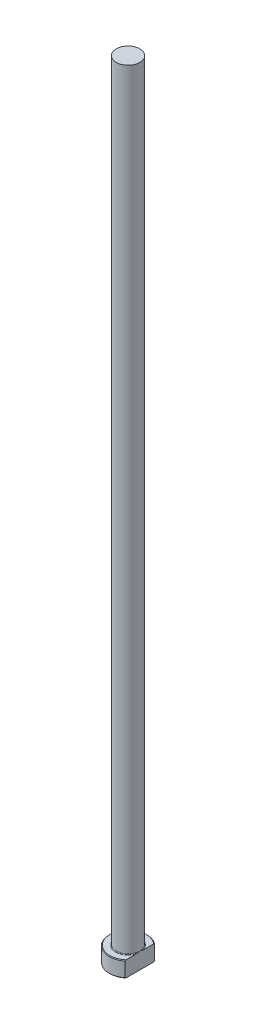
ISO-10303-21;
HEADER;
FILE_DESCRIPTION(('STEP AP214'),'2;1');
FILE_NAME('part.step','',(''),(''),'','','');
FILE_SCHEMA(('AUTOMOTIVE_DESIGN { 1 0 10303 214 1 1 1 1 }'));
ENDSEC;
DATA;
#1=APPLICATION_CONTEXT('core data for automotive mechanical design processes');
#2=APPLICATION_PROTOCOL_DEFINITION('international standard','automotive_design',2000,#1);
#3=PRODUCT_CONTEXT('',#1,'mechanical');
#4=PRODUCT('Part','Part','',(#3));
#5=PRODUCT_RELATED_PRODUCT_CATEGORY('part','',(#4));
#6=PRODUCT_DEFINITION_FORMATION('','',#4);
#7=PRODUCT_DEFINITION_CONTEXT('part definition',#1,'design');
#8=PRODUCT_DEFINITION('design','',#6,#7);
#9=PRODUCT_DEFINITION_SHAPE('','',#8);
#10=(LENGTH_UNIT() NAMED_UNIT(*) SI_UNIT(.MILLI.,.METRE.));
#11=(NAMED_UNIT(*) PLANE_ANGLE_UNIT() SI_UNIT($,.RADIAN.));
#12=(NAMED_UNIT(*) SI_UNIT($,.STERADIAN.) SOLID_ANGLE_UNIT());
#13=UNCERTAINTY_MEASURE_WITH_UNIT(LENGTH_MEASURE(1.E-05),#10,'distance_accuracy_value','');
#14=(GEOMETRIC_REPRESENTATION_CONTEXT(3) GLOBAL_UNCERTAINTY_ASSIGNED_CONTEXT((#13)) GLOBAL_UNIT_ASSIGNED_CONTEXT((#10,
#11,#12)) REPRESENTATION_CONTEXT('',''));
#15=CARTESIAN_POINT('',(0.,0.,0.));
#16=DIRECTION('',(0.,0.,1.));
#17=DIRECTION('',(1.,0.,0.));
#18=AXIS2_PLACEMENT_3D('',#15,#16,#17);
#19=CARTESIAN_POINT('',(0.,0.,0.));
#20=DIRECTION('',(0.,-1.,0.));
#21=DIRECTION('',(0.,0.,-1.));
#22=AXIS2_PLACEMENT_3D('',#19,#20,#21);
#23=PLANE('',#22);
#24=CARTESIAN_POINT('',(0.,0.,0.));
#25=DIRECTION('',(0.,-1.,0.));
#26=DIRECTION('',(0.,0.,-1.));
#27=AXIS2_PLACEMENT_3D('',#24,#25,#26);
#28=CIRCLE('',#27,5.79999999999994);
#29=CARTESIAN_POINT('',(3.74999999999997,0.,4.42464687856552));
#30=VERTEX_POINT('',#29);
#31=CARTESIAN_POINT('',(3.74999999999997,0.,-4.42464687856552));
#32=VERTEX_POINT('',#31);
#33=EDGE_CURVE('E98',#30,#32,#28,.T.);
#34=ORIENTED_EDGE('',*,*,#33,.T.);
#35=DIRECTION('',(0.,0.,1.));
#36=VECTOR('',#35,1.);
#37=CARTESIAN_POINT('',(3.74999999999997,0.,-4.68374849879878));
#38=LINE('',#37,#36);
#39=EDGE_CURVE('E83',#32,#30,#38,.T.);
#40=ORIENTED_EDGE('',*,*,#39,.T.);
#41=EDGE_LOOP('',(#34,#40));
#42=FACE_BOUND('',#41,.T.);
#43=ADVANCED_FACE('F32',(#42),#23,.T.);
#44=CARTESIAN_POINT('',(0.,259.958771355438,0.));
#45=DIRECTION('',(0.,1.,0.));
#46=DIRECTION('',(0.,0.,1.));
#47=AXIS2_PLACEMENT_3D('',#44,#45,#46);
#48=CYLINDRICAL_SURFACE('',#47,5.99999999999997);
#49=CARTESIAN_POINT('',(0.,4.80000000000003,0.));
#50=DIRECTION('',(0.,1.,0.));
#51=DIRECTION('',(0.,0.,1.));
#52=AXIS2_PLACEMENT_3D('',#49,#50,#51);
#53=CIRCLE('',#52,5.99999999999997);
#54=CARTESIAN_POINT('',(3.74999999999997,4.80000000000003,4.68374849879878));
#55=VERTEX_POINT('',#54);
#56=CARTESIAN_POINT('',(3.74999999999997,4.80000000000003,-4.68374849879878));
#57=VERTEX_POINT('',#56);
#58=EDGE_CURVE('E104',#55,#57,#53,.F.);
#59=ORIENTED_EDGE('',*,*,#58,.T.);
#60=DIRECTION('',(0.,-1.,0.));
#61=VECTOR('',#60,1.);
#62=CARTESIAN_POINT('',(3.74999999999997,250.,-4.68374849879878));
#63=LINE('',#62,#61);
#64=CARTESIAN_POINT('',(3.74999999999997,0.200000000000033,-4.68374849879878));
#65=VERTEX_POINT('',#64);
#66=EDGE_CURVE('E183',#57,#65,#63,.T.);
#67=ORIENTED_EDGE('',*,*,#66,.T.);
#68=CARTESIAN_POINT('',(0.,0.200000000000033,0.));
#69=DIRECTION('',(0.,-1.,0.));
#70=DIRECTION('',(0.,0.,-1.));
#71=AXIS2_PLACEMENT_3D('',#68,#69,#70);
#72=CIRCLE('',#71,5.99999999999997);
#73=CARTESIAN_POINT('',(3.74999999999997,0.200000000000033,4.68374849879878));
#74=VERTEX_POINT('',#73);
#75=EDGE_CURVE('E100',#65,#74,#72,.F.);
#76=ORIENTED_EDGE('',*,*,#75,.T.);
#77=DIRECTION('',(0.,-1.,0.));
#78=VECTOR('',#77,1.);
#79=CARTESIAN_POINT('',(3.74999999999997,250.,4.68374849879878));
#80=LINE('',#79,#78);
#81=EDGE_CURVE('E93',#55,#74,#80,.T.);
#82=ORIENTED_EDGE('',*,*,#81,.F.);
#83=EDGE_LOOP('',(#59,#67,#76,#82));
#84=FACE_BOUND('',#83,.T.);
#85=ADVANCED_FACE('F158',(#84),#48,.T.);
#86=CARTESIAN_POINT('',(-5.99999999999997,5.,0.));
#87=DIRECTION('',(0.,1.,0.));
#88=DIRECTION('',(0.,0.,1.));
#89=AXIS2_PLACEMENT_3D('',#86,#87,#88);
#90=PLANE('',#89);
#91=CARTESIAN_POINT('',(0.,5.,0.));
#92=DIRECTION('',(0.,1.,0.));
#93=DIRECTION('',(0.,0.,1.));
#94=AXIS2_PLACEMENT_3D('',#91,#92,#93);
#95=CIRCLE('',#94,5.79999999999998);
#96=CARTESIAN_POINT('',(3.74999999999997,5.,-4.42464687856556));
#97=VERTEX_POINT('',#96);
#98=CARTESIAN_POINT('',(3.74999999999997,5.,4.42464687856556));
#99=VERTEX_POINT('',#98);
#100=EDGE_CURVE('E178',#97,#99,#95,.T.);
#101=ORIENTED_EDGE('',*,*,#100,.T.);
#102=DIRECTION('',(0.,0.,-1.));
#103=VECTOR('',#102,1.);
#104=CARTESIAN_POINT('',(3.74999999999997,5.,0.));
#105=LINE('',#104,#103);
#106=CARTESIAN_POINT('',(3.74999999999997,4.99999999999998,1.24096736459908));
#107=VERTEX_POINT('',#106);
#108=EDGE_CURVE('E57',#99,#107,#105,.T.);
#109=ORIENTED_EDGE('',*,*,#108,.T.);
#110=CARTESIAN_POINT('',(0.,5.,0.));
#111=DIRECTION('',(0.,1.,0.));
#112=DIRECTION('',(0.,0.,1.));
#113=AXIS2_PLACEMENT_3D('',#110,#111,#112);
#114=CIRCLE('',#113,3.94999999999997);
#115=CARTESIAN_POINT('',(3.74999999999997,4.99999999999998,-1.24096736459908));
#116=VERTEX_POINT('',#115);
#117=EDGE_CURVE('E107',#107,#116,#114,.F.);
#118=ORIENTED_EDGE('',*,*,#117,.T.);
#119=EDGE_CURVE('E136',#116,#97,#105,.T.);
#120=ORIENTED_EDGE('',*,*,#119,.T.);
#121=EDGE_LOOP('',(#101,#109,#118,#120));
#122=FACE_BOUND('',#121,.T.);
#123=ADVANCED_FACE('F147',(#122),#90,.T.);
#124=CARTESIAN_POINT('',(0.,5.,0.));
#125=DIRECTION('',(0.,-1.,0.));
#126=DIRECTION('',(0.,0.,-1.));
#127=AXIS2_PLACEMENT_3D('',#124,#125,#126);
#128=CONICAL_SURFACE('',#127,5.79999999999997,0.785398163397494);
#129=ORIENTED_EDGE('',*,*,#58,.F.);
#130=CARTESIAN_POINT('',(3.74999999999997,-0.166791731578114,10.3057275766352));
#131=CARTESIAN_POINT('',(3.74999999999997,-0.014731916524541,10.1439111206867));
#132=CARTESIAN_POINT('',(3.74999999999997,0.137108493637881,9.9818885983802));
#133=CARTESIAN_POINT('',(3.74999999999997,0.440278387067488,9.65736450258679));
#134=CARTESIAN_POINT('',(3.74999999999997,0.591607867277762,9.49486292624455));
#135=CARTESIAN_POINT('',(3.74999999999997,1.044927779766,9.00631715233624));
#136=CARTESIAN_POINT('',(3.74999999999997,1.34603930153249,8.67945539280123));
#137=CARTESIAN_POINT('',(3.74999999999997,1.95254712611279,8.01460794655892));
#138=CARTESIAN_POINT('',(3.74999999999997,2.25786252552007,7.67654836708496));
#139=CARTESIAN_POINT('',(3.74999999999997,2.86353617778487,6.9963620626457));
#140=CARTESIAN_POINT('',(3.74999999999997,3.1638973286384,6.65423793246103));
#141=CARTESIAN_POINT('',(3.74999999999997,3.60894976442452,6.13647931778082));
#142=CARTESIAN_POINT('',(3.74999999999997,3.75634976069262,5.96317466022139));
#143=CARTESIAN_POINT('',(3.74999999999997,4.04886653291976,5.61465145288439));
#144=CARTESIAN_POINT('',(3.74999999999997,4.19398335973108,5.43943294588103));
#145=CARTESIAN_POINT('',(3.74999999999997,4.48160030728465,5.08627546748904));
#146=CARTESIAN_POINT('',(3.74999999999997,4.62409465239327,4.90833178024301));
#147=CARTESIAN_POINT('',(3.74999999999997,4.90527650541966,4.54947349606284));
#148=CARTESIAN_POINT('',(3.74999999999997,5.04396432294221,4.36855914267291));
#149=CARTESIAN_POINT('',(3.74999999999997,5.31490367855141,4.00479441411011));
#150=CARTESIAN_POINT('',(3.74999999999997,5.44720614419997,3.8219821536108));
#151=CARTESIAN_POINT('',(3.74999999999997,5.70510811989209,3.45154087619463));
#152=CARTESIAN_POINT('',(3.74999999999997,5.83070495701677,3.26390998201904));
#153=CARTESIAN_POINT('',(3.74999999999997,6.07201012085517,2.8832304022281));
#154=CARTESIAN_POINT('',(3.74999999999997,6.18775038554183,2.69020213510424));
#155=CARTESIAN_POINT('',(3.74999999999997,6.40563683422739,2.29668805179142));
#156=CARTESIAN_POINT('',(3.74999999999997,6.50779706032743,2.09621021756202));
#157=CARTESIAN_POINT('',(3.74999999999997,6.65161366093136,1.77679443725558));
#158=CARTESIAN_POINT('',(3.74999999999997,6.70007114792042,1.66092791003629));
#159=CARTESIAN_POINT('',(3.74999999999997,6.78940124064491,1.42624849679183));
#160=CARTESIAN_POINT('',(3.74999999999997,6.83027262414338,1.30743513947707));
#161=CARTESIAN_POINT('',(3.74999999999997,6.90263144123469,1.06768570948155));
#162=CARTESIAN_POINT('',(3.74999999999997,6.93417098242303,0.946765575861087));
#163=CARTESIAN_POINT('',(3.74999999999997,6.98660653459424,0.702615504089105));
#164=CARTESIAN_POINT('',(3.74999999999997,7.00750376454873,0.579385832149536));
#165=CARTESIAN_POINT('',(3.74999999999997,7.03759634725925,0.329742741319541));
#166=CARTESIAN_POINT('',(3.74999999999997,7.04662553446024,0.203308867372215));
#167=CARTESIAN_POINT('',(3.74999999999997,7.05180393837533,-0.0498149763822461));
#168=CARTESIAN_POINT('',(3.74999999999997,7.04795437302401,-0.176504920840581));
#169=CARTESIAN_POINT('',(3.74999999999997,7.02762041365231,-0.429279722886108));
#170=CARTESIAN_POINT('',(3.74999999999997,7.01109328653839,-0.555361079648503));
#171=CARTESIAN_POINT('',(3.74999999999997,6.96645264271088,-0.805449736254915));
#172=CARTESIAN_POINT('',(3.74999999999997,6.93833559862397,-0.929456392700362));
#173=CARTESIAN_POINT('',(3.74999999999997,6.86047960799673,-1.2176807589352));
#174=CARTESIAN_POINT('',(3.74999999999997,6.80661715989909,-1.38077734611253));
#175=CARTESIAN_POINT('',(3.74999999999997,6.68470595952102,-1.70153361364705));
#176=CARTESIAN_POINT('',(3.74999999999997,6.61664932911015,-1.85919021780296));
#177=CARTESIAN_POINT('',(3.74999999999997,6.46902362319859,-2.17116554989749));
#178=CARTESIAN_POINT('',(3.74999999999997,6.38933187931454,-2.32542554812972));
#179=CARTESIAN_POINT('',(3.74999999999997,6.26368569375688,-2.55336011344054));
#180=CARTESIAN_POINT('',(3.74999999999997,6.22079127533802,-2.62875319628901));
#181=CARTESIAN_POINT('',(3.74999999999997,6.13321972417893,-2.77849310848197));
#182=CARTESIAN_POINT('',(3.74999999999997,6.08854268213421,-2.85283999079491));
#183=CARTESIAN_POINT('',(3.74999999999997,5.93129752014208,-3.10843214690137));
#184=CARTESIAN_POINT('',(3.74999999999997,5.81483468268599,-3.28728416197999));
#185=CARTESIAN_POINT('',(3.74999999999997,5.57519396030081,-3.6404510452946));
#186=CARTESIAN_POINT('',(3.74999999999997,5.45201411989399,-3.81476457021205));
#187=CARTESIAN_POINT('',(3.74999999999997,5.20057170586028,-4.15993775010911));
#188=CARTESIAN_POINT('',(3.74999999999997,5.07230420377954,-4.3307938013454));
#189=CARTESIAN_POINT('',(3.74999999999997,4.81202699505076,-4.66958927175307));
#190=CARTESIAN_POINT('',(3.74999999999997,4.68001769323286,-4.83752900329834));
#191=CARTESIAN_POINT('',(3.74999999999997,4.41253585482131,-5.17177751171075));
#192=CARTESIAN_POINT('',(3.74999999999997,4.27705112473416,-5.3380765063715));
#193=CARTESIAN_POINT('',(3.74999999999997,4.0037688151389,-5.66876488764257));
#194=CARTESIAN_POINT('',(3.74999999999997,3.8659711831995,-5.83315423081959));
#195=CARTESIAN_POINT('',(3.74999999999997,3.44998502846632,-6.32380284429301));
#196=CARTESIAN_POINT('',(3.74999999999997,3.16904977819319,-6.64773216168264));
#197=CARTESIAN_POINT('',(3.74999999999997,2.63560043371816,-7.25347079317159));
#198=CARTESIAN_POINT('',(3.74999999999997,2.38362498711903,-7.53575743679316));
#199=CARTESIAN_POINT('',(3.74999999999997,1.8768348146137,-8.09784913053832));
#200=CARTESIAN_POINT('',(3.74999999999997,1.62201964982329,-8.3776537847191));
#201=CARTESIAN_POINT('',(3.74999999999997,1.11240843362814,-8.93303089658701));
#202=CARTESIAN_POINT('',(3.74999999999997,0.857629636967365,-9.20861921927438));
#203=CARTESIAN_POINT('',(3.74999999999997,0.346500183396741,-9.75823398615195));
#204=CARTESIAN_POINT('',(3.74999999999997,0.0901498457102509,-10.0322607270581));
#205=CARTESIAN_POINT('',(3.74999999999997,-0.166791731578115,-10.3057275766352));
#206=B_SPLINE_CURVE_WITH_KNOTS('',3,(#130,#131,#132,#133,#134,#135,#136,#137,#138,#139,#140,
#141,#142,#143,#144,#145,#146,#147,#148,#149,#150,#151,#152,#153,#154,#155,#156,#157,#158,#159,
#160,#161,#162,#163,#164,#165,#166,#167,#168,#169,#170,#171,#172,#173,#174,#175,#176,#177,#178,
#179,#180,#181,#182,#183,#184,#185,#186,#187,#188,#189,#190,#191,#192,#193,#194,#195,#196,#197,
#198,#199,#200,#201,#202,#203,#204,#205),.UNSPECIFIED.,.F.,.F.,(4,2,2,2,2,2,2,2,2,2,2,2,2,2,2,2,
2,2,2,2,2,2,2,2,2,2,2,2,2,2,2,2,2,2,2,2,2,4),(0.,0.666153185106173,1.33231034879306,
2.66554544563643,4.03209014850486,5.39780491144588,6.08032329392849,6.76282645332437,
7.44668645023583,8.13049065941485,8.80737551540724,9.48452819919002,10.1593958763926,
10.8335602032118,11.210125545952,11.586751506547,11.9612329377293,12.3356714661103,
12.7152985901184,13.0948898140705,13.4757662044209,13.8567585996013,14.3711324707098,
14.8857925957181,15.4063338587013,15.6665395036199,15.9267319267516,16.5667748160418,
17.2070050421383,17.8478713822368,18.4886686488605,19.1321508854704,19.7756477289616,
21.0619101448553,22.1970548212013,23.3323774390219,24.4583149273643,25.5840308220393),.UNSPECIFIED.);
#207=EDGE_CURVE('E135',#55,#99,#206,.T.);
#208=ORIENTED_EDGE('',*,*,#207,.T.);
#209=ORIENTED_EDGE('',*,*,#100,.F.);
#210=EDGE_CURVE('E127',#97,#57,#206,.T.);
#211=ORIENTED_EDGE('',*,*,#210,.T.);
#212=EDGE_LOOP('',(#129,#208,#209,#211));
#213=FACE_BOUND('',#212,.T.);
#214=ADVANCED_FACE('F143',(#213),#128,.T.);
#215=CARTESIAN_POINT('',(0.,0.200000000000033,0.));
#216=DIRECTION('',(0.,1.,0.));
#217=DIRECTION('',(0.,0.,1.));
#218=AXIS2_PLACEMENT_3D('',#215,#216,#217);
#219=CONICAL_SURFACE('',#218,5.99999999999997,0.785398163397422);
#220=ORIENTED_EDGE('',*,*,#75,.F.);
#221=CARTESIAN_POINT('',(3.74999999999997,5.16679173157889,-10.3057275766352));
#222=CARTESIAN_POINT('',(3.74999999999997,5.0147319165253,-10.1439111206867));
#223=CARTESIAN_POINT('',(3.74999999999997,4.86289150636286,-9.98188859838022));
#224=CARTESIAN_POINT('',(3.74999999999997,4.55972161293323,-9.65736450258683));
#225=CARTESIAN_POINT('',(3.74999999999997,4.40839213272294,-9.4948629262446));
#226=CARTESIAN_POINT('',(3.74999999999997,3.95507222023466,-9.00631715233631));
#227=CARTESIAN_POINT('',(3.74999999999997,3.65396069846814,-8.67945539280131));
#228=CARTESIAN_POINT('',(3.74999999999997,3.04745287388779,-8.01460794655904));
#229=CARTESIAN_POINT('',(3.74999999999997,2.74213747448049,-7.67654836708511));
#230=CARTESIAN_POINT('',(3.74999999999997,2.13646382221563,-6.99636206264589));
#231=CARTESIAN_POINT('',(3.74999999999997,1.83610267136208,-6.65423793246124));
#232=CARTESIAN_POINT('',(3.74999999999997,1.39105023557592,-6.13647931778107));
#233=CARTESIAN_POINT('',(3.74999999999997,1.24365023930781,-5.96317466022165));
#234=CARTESIAN_POINT('',(3.74999999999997,0.951133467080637,-5.61465145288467));
#235=CARTESIAN_POINT('',(3.74999999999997,0.806016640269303,-5.43943294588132));
#236=CARTESIAN_POINT('',(3.74999999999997,0.518399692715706,-5.08627546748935));
#237=CARTESIAN_POINT('',(3.74999999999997,0.375905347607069,-4.90833178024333));
#238=CARTESIAN_POINT('',(3.74999999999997,0.0947234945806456,-4.54947349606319));
#239=CARTESIAN_POINT('',(3.74999999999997,-0.043964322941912,-4.36855914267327));
#240=CARTESIAN_POINT('',(3.74999999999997,-0.314903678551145,-4.00479441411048));
#241=CARTESIAN_POINT('',(3.74999999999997,-0.44720614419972,-3.82198215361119));
#242=CARTESIAN_POINT('',(3.74999999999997,-0.705108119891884,-3.45154087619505));
#243=CARTESIAN_POINT('',(3.74999999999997,-0.830704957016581,-3.26390998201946));
#244=CARTESIAN_POINT('',(3.74999999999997,-1.07201012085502,-2.88323040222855));
#245=CARTESIAN_POINT('',(3.74999999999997,-1.1877503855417,-2.6902021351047));
#246=CARTESIAN_POINT('',(3.74999999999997,-1.40563683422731,-2.29668805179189));
#247=CARTESIAN_POINT('',(3.74999999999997,-1.50779706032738,-2.0962102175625));
#248=CARTESIAN_POINT('',(3.74999999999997,-1.65161366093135,-1.77679443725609));
#249=CARTESIAN_POINT('',(3.74999999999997,-1.70007114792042,-1.6609279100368));
#250=CARTESIAN_POINT('',(3.74999999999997,-1.78940124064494,-1.42624849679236));
#251=CARTESIAN_POINT('',(3.74999999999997,-1.83027262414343,-1.30743513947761));
#252=CARTESIAN_POINT('',(3.74999999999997,-1.90263144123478,-1.06768570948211));
#253=CARTESIAN_POINT('',(3.74999999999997,-1.93417098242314,-0.946765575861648));
#254=CARTESIAN_POINT('',(3.74999999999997,-1.98660653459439,-0.702615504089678));
#255=CARTESIAN_POINT('',(3.74999999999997,-2.0075037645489,-0.579385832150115));
#256=CARTESIAN_POINT('',(3.74999999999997,-2.03759634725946,-0.329742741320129));
#257=CARTESIAN_POINT('',(3.74999999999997,-2.04662553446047,-0.203308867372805));
#258=CARTESIAN_POINT('',(3.74999999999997,-2.0518039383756,0.0498149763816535));
#259=CARTESIAN_POINT('',(3.74999999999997,-2.0479543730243,0.176504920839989));
#260=CARTESIAN_POINT('',(3.74999999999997,-2.02762041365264,0.429279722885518));
#261=CARTESIAN_POINT('',(3.74999999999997,-2.01109328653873,0.555361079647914));
#262=CARTESIAN_POINT('',(3.74999999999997,-1.96645264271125,0.80544973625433));
#263=CARTESIAN_POINT('',(3.74999999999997,-1.93833559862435,0.92945639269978));
#264=CARTESIAN_POINT('',(3.74999999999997,-1.86047960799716,1.21768075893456));
#265=CARTESIAN_POINT('',(3.74999999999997,-1.80661715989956,1.38077734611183));
#266=CARTESIAN_POINT('',(3.74999999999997,-1.68470595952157,1.70153361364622));
#267=CARTESIAN_POINT('',(3.74999999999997,-1.61664932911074,1.85919021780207));
#268=CARTESIAN_POINT('',(3.74999999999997,-1.46902362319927,2.17116554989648));
#269=CARTESIAN_POINT('',(3.74999999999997,-1.38933187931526,2.32542554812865));
#270=CARTESIAN_POINT('',(3.74999999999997,-1.26368569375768,2.55336011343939));
#271=CARTESIAN_POINT('',(3.74999999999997,-1.22079127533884,2.62875319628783));
#272=CARTESIAN_POINT('',(3.74999999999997,-1.13321972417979,2.77849310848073));
#273=CARTESIAN_POINT('',(3.74999999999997,-1.0885426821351,2.85283999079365));
#274=CARTESIAN_POINT('',(3.74999999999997,-0.931297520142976,3.10843214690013));
#275=CARTESIAN_POINT('',(3.74999999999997,-0.814834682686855,3.28728416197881));
#276=CARTESIAN_POINT('',(3.74999999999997,-0.57519396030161,3.64045104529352));
#277=CARTESIAN_POINT('',(3.74999999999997,-0.452014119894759,3.81476457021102));
#278=CARTESIAN_POINT('',(3.74999999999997,-0.200571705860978,4.15993775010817));
#279=CARTESIAN_POINT('',(3.74999999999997,-0.0723042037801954,4.33079380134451));
#280=CARTESIAN_POINT('',(3.74999999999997,0.187973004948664,4.66958927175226));
#281=CARTESIAN_POINT('',(3.74999999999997,0.319982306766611,4.83752900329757));
#282=CARTESIAN_POINT('',(3.74999999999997,0.587464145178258,5.17177751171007));
#283=CARTESIAN_POINT('',(3.74999999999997,0.722948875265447,5.33807650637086));
#284=CARTESIAN_POINT('',(3.74999999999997,0.996231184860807,5.66876488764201));
#285=CARTESIAN_POINT('',(3.74999999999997,1.13402881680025,5.83315423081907));
#286=CARTESIAN_POINT('',(3.74999999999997,1.55001497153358,6.3238028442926));
#287=CARTESIAN_POINT('',(3.74999999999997,1.83095022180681,6.64773216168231));
#288=CARTESIAN_POINT('',(3.74999999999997,2.36439956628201,7.25347079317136));
#289=CARTESIAN_POINT('',(3.74999999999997,2.61637501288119,7.53575743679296));
#290=CARTESIAN_POINT('',(3.74999999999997,3.12316518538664,8.09784913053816));
#291=CARTESIAN_POINT('',(3.74999999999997,3.37798035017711,8.37765378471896));
#292=CARTESIAN_POINT('',(3.74999999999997,3.88759156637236,8.93303089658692));
#293=CARTESIAN_POINT('',(3.74999999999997,4.14237036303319,9.2086192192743));
#294=CARTESIAN_POINT('',(3.74999999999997,4.65349981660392,9.75823398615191));
#295=CARTESIAN_POINT('',(3.74999999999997,4.90985015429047,10.0322607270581));
#296=CARTESIAN_POINT('',(3.74999999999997,5.16679173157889,10.3057275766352));
#297=B_SPLINE_CURVE_WITH_KNOTS('',3,(#221,#222,#223,#224,#225,#226,#227,#228,#229,#230,#231,
#232,#233,#234,#235,#236,#237,#238,#239,#240,#241,#242,#243,#244,#245,#246,#247,#248,#249,#250,
#251,#252,#253,#254,#255,#256,#257,#258,#259,#260,#261,#262,#263,#264,#265,#266,#267,#268,#269,
#270,#271,#272,#273,#274,#275,#276,#277,#278,#279,#280,#281,#282,#283,#284,#285,#286,#287,#288,
#289,#290,#291,#292,#293,#294,#295,#296),.UNSPECIFIED.,.F.,.F.,(4,2,2,2,2,2,2,2,2,2,2,2,2,2,2,2,
2,2,2,2,2,2,2,2,2,2,2,2,2,2,2,2,2,2,2,2,2,4),(0.,0.666153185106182,1.33231034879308,
2.66554544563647,4.0320901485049,5.39780491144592,6.08032329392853,6.76282645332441,
7.44668645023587,8.13049065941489,8.80737551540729,9.48452819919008,10.1593958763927,
10.8335602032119,11.2101255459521,11.586751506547,11.9612329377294,12.3356714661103,
12.7152985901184,13.0948898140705,13.4757662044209,13.8567585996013,14.3711324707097,
14.8857925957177,15.4063338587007,15.6665395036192,15.9267319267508,16.5667748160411,
17.2070050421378,17.8478713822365,18.4886686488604,19.1321508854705,19.7756477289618,
21.0619101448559,22.1970548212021,23.3323774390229,24.4583149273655,25.5840308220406),.UNSPECIFIED.);
#298=EDGE_CURVE('E86',#65,#32,#297,.T.);
#299=ORIENTED_EDGE('',*,*,#298,.T.);
#300=ORIENTED_EDGE('',*,*,#33,.F.);
#301=EDGE_CURVE('E89',#30,#74,#297,.T.);
#302=ORIENTED_EDGE('',*,*,#301,.T.);
#303=EDGE_LOOP('',(#220,#299,#300,#302));
#304=FACE_BOUND('',#303,.T.);
#305=ADVANCED_FACE('F97',(#304),#219,.T.);
#306=CARTESIAN_POINT('',(0.,5.19999999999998,0.));
#307=DIRECTION('',(0.,1.,0.));
#308=DIRECTION('',(0.,0.,1.));
#309=AXIS2_PLACEMENT_3D('',#306,#307,#308);
#310=TOROIDAL_SURFACE('',#309,3.94999999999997,0.2);
#311=CARTESIAN_POINT('',(3.74999999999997,5.19999999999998,0.));
#312=CARTESIAN_POINT('',(3.74999999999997,5.20000051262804,-2.87877875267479E-10));
#313=CARTESIAN_POINT('',(3.74999999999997,5.2000010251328,-2.25357307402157E-07));
#314=CARTESIAN_POINT('',(3.74999999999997,5.20000197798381,-8.32474472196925E-07));
#315=CARTESIAN_POINT('',(3.74999999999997,5.20000240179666,-1.23037624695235E-06));
#316=CARTESIAN_POINT('',(3.74999999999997,5.20000329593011,-2.1874363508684E-06));
#317=CARTESIAN_POINT('',(3.74999999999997,5.20000375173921,-2.76211833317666E-06));
#318=CARTESIAN_POINT('',(3.74999999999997,5.20000455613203,-3.94274255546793E-06));
#319=CARTESIAN_POINT('',(3.74999999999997,5.20000490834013,-4.54644341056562E-06));
#320=CARTESIAN_POINT('',(3.74999999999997,5.20000624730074,-6.92466681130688E-06));
#321=CARTESIAN_POINT('',(3.74999999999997,5.20000716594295,-8.74076191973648E-06));
#322=CARTESIAN_POINT('',(3.74999999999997,5.20000864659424,-1.2305250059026E-05));
#323=CARTESIAN_POINT('',(3.74999999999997,5.20000923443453,-1.4043310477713E-05));
#324=CARTESIAN_POINT('',(3.74999999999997,5.20001175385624,-2.15092611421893E-05));
#325=CARTESIAN_POINT('',(3.74999999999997,5.20001367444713,-2.72432101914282E-05));
#326=CARTESIAN_POINT('',(3.74999999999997,5.20001644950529,-3.79951292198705E-05));
#327=CARTESIAN_POINT('',(3.74999999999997,5.20001742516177,-4.29814178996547E-05));
#328=CARTESIAN_POINT('',(3.74999999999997,5.20002460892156,-8.03310024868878E-05));
#329=CARTESIAN_POINT('',(3.74999999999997,5.20003015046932,-0.000112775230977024));
#330=CARTESIAN_POINT('',(3.74999999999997,5.20005437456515,-0.000241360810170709));
#331=CARTESIAN_POINT('',(3.74999999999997,5.20007738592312,-0.000336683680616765));
#332=CARTESIAN_POINT('',(3.74999999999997,5.2001672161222,-0.000714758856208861));
#333=CARTESIAN_POINT('',(3.74999999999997,5.20023131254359,-0.000997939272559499));
#334=CARTESIAN_POINT('',(3.74999999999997,5.20048834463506,-0.00212553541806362));
#335=CARTESIAN_POINT('',(3.74999999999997,5.20068473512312,-0.00296938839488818));
#336=CARTESIAN_POINT('',(3.74999999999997,5.20150889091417,-0.00651948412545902));
#337=CARTESIAN_POINT('',(3.74999999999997,5.20213227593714,-0.00922644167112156));
#338=CARTESIAN_POINT('',(3.74999999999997,5.21093696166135,-0.047449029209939));
#339=CARTESIAN_POINT('',(3.74999999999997,5.21914648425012,-0.0829604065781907));
#340=CARTESIAN_POINT('',(3.74999999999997,5.23634325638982,-0.157927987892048));
#341=CARTESIAN_POINT('',(3.74999999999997,5.24531641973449,-0.197387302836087));
#342=CARTESIAN_POINT('',(3.74999999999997,5.26041433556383,-0.264774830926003));
#343=CARTESIAN_POINT('',(3.74999999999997,5.26660221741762,-0.292688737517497));
#344=CARTESIAN_POINT('',(3.74999999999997,5.27863779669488,-0.347814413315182));
#345=CARTESIAN_POINT('',(3.74999999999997,5.28449016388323,-0.375025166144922));
#346=CARTESIAN_POINT('',(3.74999999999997,5.30189789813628,-0.457537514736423));
#347=CARTESIAN_POINT('',(3.74999999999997,5.31311990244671,-0.512910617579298));
#348=CARTESIAN_POINT('',(3.74999999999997,5.33435371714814,-0.624416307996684));
#349=CARTESIAN_POINT('',(3.74999999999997,5.34435351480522,-0.68055120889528));
#350=CARTESIAN_POINT('',(3.74999999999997,5.3633402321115,-0.798309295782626));
#351=CARTESIAN_POINT('',(3.74999999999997,5.37214919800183,-0.859962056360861));
#352=CARTESIAN_POINT('',(3.74999999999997,5.38667037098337,-0.983470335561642));
#353=CARTESIAN_POINT('',(3.74999999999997,5.39239104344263,-1.04532482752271));
#354=CARTESIAN_POINT('',(3.74999999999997,5.39944323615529,-1.16735704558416));
#355=CARTESIAN_POINT('',(3.74999999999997,5.40090877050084,-1.22752541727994));
#356=CARTESIAN_POINT('',(3.74999999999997,5.39872274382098,-1.31720401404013));
#357=CARTESIAN_POINT('',(3.74999999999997,5.39729193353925,-1.34676575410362));
#358=CARTESIAN_POINT('',(3.74999999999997,5.39265012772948,-1.40574048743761));
#359=CARTESIAN_POINT('',(3.74999999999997,5.38944021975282,-1.43515356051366));
#360=CARTESIAN_POINT('',(3.74999999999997,5.38068094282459,-1.49396538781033));
#361=CARTESIAN_POINT('',(3.74999999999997,5.37510711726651,-1.52336068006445));
#362=CARTESIAN_POINT('',(3.74999999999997,5.36076919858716,-1.58137061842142));
#363=CARTESIAN_POINT('',(3.74999999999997,5.35200919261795,-1.60998621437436));
#364=CARTESIAN_POINT('',(3.74999999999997,5.33238965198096,-1.65861686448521));
#365=CARTESIAN_POINT('',(3.74999999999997,5.32257316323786,-1.67901898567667));
#366=CARTESIAN_POINT('',(3.74999999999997,5.30467241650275,-1.70783277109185));
#367=CARTESIAN_POINT('',(3.74999999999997,5.29812945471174,-1.71718739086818));
#368=CARTESIAN_POINT('',(3.74999999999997,5.2837001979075,-1.73480018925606));
#369=CARTESIAN_POINT('',(3.74999999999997,5.27581911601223,-1.74306240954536));
#370=CARTESIAN_POINT('',(3.74999999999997,5.26261463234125,-1.75418373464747));
#371=CARTESIAN_POINT('',(3.74999999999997,5.25787681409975,-1.75773399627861));
#372=CARTESIAN_POINT('',(3.74999999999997,5.24794673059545,-1.76414289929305));
#373=CARTESIAN_POINT('',(3.74999999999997,5.24275459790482,-1.76700174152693));
#374=CARTESIAN_POINT('',(3.74999999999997,5.23188845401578,-1.77184194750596));
#375=CARTESIAN_POINT('',(3.74999999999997,5.22620925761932,-1.77381196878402));
#376=CARTESIAN_POINT('',(3.74999999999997,5.21457526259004,-1.77659633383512));
#377=CARTESIAN_POINT('',(3.74999999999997,5.20862098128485,-1.77741276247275));
#378=CARTESIAN_POINT('',(3.74999999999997,5.19743537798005,-1.77775957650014));
#379=CARTESIAN_POINT('',(3.74999999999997,5.19220837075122,-1.77744024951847));
#380=CARTESIAN_POINT('',(3.74999999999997,5.18189414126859,-1.7758778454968));
#381=CARTESIAN_POINT('',(3.74999999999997,5.17680701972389,-1.77463412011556));
#382=CARTESIAN_POINT('',(3.74999999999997,5.16595570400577,-1.7710259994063));
#383=CARTESIAN_POINT('',(3.74999999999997,5.16024847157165,-1.76849257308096));
#384=CARTESIAN_POINT('',(3.74999999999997,5.14931958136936,-1.76253978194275));
#385=CARTESIAN_POINT('',(3.74999999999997,5.14409879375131,-1.75911886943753));
#386=CARTESIAN_POINT('',(3.74999999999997,5.13137207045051,-1.74952862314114));
#387=CARTESIAN_POINT('',(3.74999999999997,5.12422146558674,-1.74289229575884));
#388=CARTESIAN_POINT('',(3.74999999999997,5.11098063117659,-1.72864029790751));
#389=CARTESIAN_POINT('',(3.74999999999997,5.1048935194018,-1.72102185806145));
#390=CARTESIAN_POINT('',(3.74999999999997,5.08827617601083,-1.69771313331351));
#391=CARTESIAN_POINT('',(3.74999999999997,5.07895354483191,-1.68117193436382));
#392=CARTESIAN_POINT('',(3.74999999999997,5.06261247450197,-1.64704828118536));
#393=CARTESIAN_POINT('',(3.74999999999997,5.05559655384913,-1.62946471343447));
#394=CARTESIAN_POINT('',(3.74999999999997,5.04053076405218,-1.58583200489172));
#395=CARTESIAN_POINT('',(3.74999999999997,5.03339137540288,-1.55947193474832));
#396=CARTESIAN_POINT('',(3.74999999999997,5.02157296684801,-1.50618793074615));
#397=CARTESIAN_POINT('',(3.74999999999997,5.01689927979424,-1.47926290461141));
#398=CARTESIAN_POINT('',(3.74999999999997,5.00936793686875,-1.42466530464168));
#399=CARTESIAN_POINT('',(3.74999999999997,5.00654501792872,-1.39698806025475));
#400=CARTESIAN_POINT('',(3.74999999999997,5.00244752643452,-1.34156614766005));
#401=CARTESIAN_POINT('',(3.74999999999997,5.00117081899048,-1.31382162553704));
#402=CARTESIAN_POINT('',(3.74999999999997,4.99934872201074,-1.2362264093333));
#403=CARTESIAN_POINT('',(3.74999999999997,5.00019255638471,-1.18634383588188));
#404=CARTESIAN_POINT('',(3.74999999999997,5.00481837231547,-1.08670490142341));
#405=CARTESIAN_POINT('',(3.74999999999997,5.00860250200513,-1.03694865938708));
#406=CARTESIAN_POINT('',(3.74999999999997,5.02331363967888,-0.887521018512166));
#407=CARTESIAN_POINT('',(3.74999999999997,5.03759480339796,-0.788187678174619));
#408=CARTESIAN_POINT('',(3.74999999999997,5.06960041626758,-0.600482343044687));
#409=CARTESIAN_POINT('',(3.74999999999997,5.08683046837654,-0.512017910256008));
#410=CARTESIAN_POINT('',(3.74999999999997,5.12342991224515,-0.336669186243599));
#411=CARTESIAN_POINT('',(3.74999999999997,5.14277046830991,-0.249778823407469));
#412=CARTESIAN_POINT('',(3.74999999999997,5.16735885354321,-0.141807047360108));
#413=CARTESIAN_POINT('',(3.74999999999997,5.17220802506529,-0.120630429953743));
#414=CARTESIAN_POINT('',(3.74999999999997,5.18059064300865,-0.0841346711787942));
#415=CARTESIAN_POINT('',(3.74999999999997,5.1841173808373,-0.0688139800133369));
#416=CARTESIAN_POINT('',(3.74999999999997,5.1908487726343,-0.0396407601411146));
#417=CARTESIAN_POINT('',(3.74999999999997,5.19405197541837,-0.0257879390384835));
#418=CARTESIAN_POINT('',(3.74999999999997,5.1978642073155,-0.00924234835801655));
#419=CARTESIAN_POINT('',(3.74999999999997,5.19848382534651,-0.00655125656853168));
#420=CARTESIAN_POINT('',(3.74999999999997,5.19930710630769,-0.00300474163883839));
#421=CARTESIAN_POINT('',(3.74999999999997,5.19950636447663,-0.00214860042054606));
#422=CARTESIAN_POINT('',(3.74999999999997,5.19976688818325,-0.00100569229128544));
#423=CARTESIAN_POINT('',(3.74999999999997,5.19983166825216,-0.000719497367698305));
#424=CARTESIAN_POINT('',(3.74999999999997,5.19992231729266,-0.000337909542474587));
#425=CARTESIAN_POINT('',(3.74999999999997,5.19994544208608,-0.000242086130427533));
#426=CARTESIAN_POINT('',(3.74999999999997,5.1999697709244,-0.00011292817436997));
#427=CARTESIAN_POINT('',(3.74999999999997,5.19997532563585,-8.04160223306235E-05));
#428=CARTESIAN_POINT('',(3.74999999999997,5.19998253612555,-4.29967852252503E-05));
#429=CARTESIAN_POINT('',(3.74999999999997,5.19998351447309,-3.80069370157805E-05));
#430=CARTESIAN_POINT('',(3.74999999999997,5.19998629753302,-2.72475249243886E-05));
#431=CARTESIAN_POINT('',(3.74999999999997,5.19998822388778,-2.15098292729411E-05));
#432=CARTESIAN_POINT('',(3.74999999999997,5.19999075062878,-1.40399367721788E-05));
#433=CARTESIAN_POINT('',(3.74999999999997,5.19999133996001,-1.23016119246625E-05));
#434=CARTESIAN_POINT('',(3.74999999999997,5.19999282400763,-8.73682092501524E-06));
#435=CARTESIAN_POINT('',(3.74999999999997,5.19999374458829,-6.92072367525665E-06));
#436=CARTESIAN_POINT('',(3.74999999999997,5.19999508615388,-4.54275759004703E-06));
#437=CARTESIAN_POINT('',(3.74999999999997,5.19999543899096,-3.93920665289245E-06));
#438=CARTESIAN_POINT('',(3.74999999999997,5.19999624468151,-2.7589957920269E-06));
#439=CARTESIAN_POINT('',(3.74999999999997,5.19999670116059,-2.18458256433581E-06));
#440=CARTESIAN_POINT('',(3.74999999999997,5.19999759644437,-1.22814421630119E-06));
#441=CARTESIAN_POINT('',(3.74999999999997,5.19999802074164,-8.30569674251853E-07));
#442=CARTESIAN_POINT('',(3.74999999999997,5.19999897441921,-2.24293963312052E-07));
#443=CARTESIAN_POINT('',(3.74999999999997,5.19999948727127,2.87934400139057E-10));
#444=CARTESIAN_POINT('',(3.74999999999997,5.19999999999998,0.));
#445=B_SPLINE_CURVE_WITH_KNOTS('',3,(#311,#312,#313,#314,#315,#316,#317,#318,#319,#320,#321,
#322,#323,#324,#325,#326,#327,#328,#329,#330,#331,#332,#333,#334,#335,#336,#337,#338,#339,#340,
#341,#342,#343,#344,#345,#346,#347,#348,#349,#350,#351,#352,#353,#354,#355,#356,#357,#358,#359,
#360,#361,#362,#363,#364,#365,#366,#367,#368,#369,#370,#371,#372,#373,#374,#375,#376,#377,#378,
#379,#380,#381,#382,#383,#384,#385,#386,#387,#388,#389,#390,#391,#392,#393,#394,#395,#396,#397,
#398,#399,#400,#401,#402,#403,#404,#405,#406,#407,#408,#409,#410,#411,#412,#413,#414,#415,#416,
#417,#418,#419,#420,#421,#422,#423,#424,#425,#426,#427,#428,#429,#430,#431,#432,#433,#434,#435,
#436,#437,#438,#439,#440,#441,#442,#443,#444),.UNSPECIFIED.,.T.,.F.,(4,2,2,2,2,2,2,2,2,2,2,2,2,
2,2,2,2,2,2,2,2,2,2,2,2,2,2,2,2,2,2,2,2,2,2,2,2,2,2,2,2,2,2,2,2,2,2,2,2,2,2,2,2,2,2,2,2,2,2,2,2,
2,2,2,2,2,4),(0.,1.56024700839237E-06,3.31164948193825E-06,5.49717735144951E-06,
7.59327506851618E-06,1.36787180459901E-05,1.91779081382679E-05,3.7292487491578E-05,
5.25176797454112E-05,0.000151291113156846,0.000445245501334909,0.00131651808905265,
0.00391543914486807,0.0122492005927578,0.121590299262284,0.242990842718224,0.328764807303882,
0.412263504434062,0.581748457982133,0.752784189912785,0.939563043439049,1.12582728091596,
1.30615794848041,1.3949070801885,1.48360201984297,1.57323786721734,1.66275913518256,
1.73030791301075,1.76447537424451,1.79851265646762,1.81622926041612,1.83394071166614,
1.85187219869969,1.86977123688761,1.885394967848,1.90102966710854,1.91965920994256,
1.9383214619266,1.9674229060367,1.99660828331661,2.05325108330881,2.10995552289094,
2.19168848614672,2.27359750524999,2.35700291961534,2.44029304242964,2.5898264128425,
2.7394691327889,3.04023923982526,3.31058675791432,3.57761795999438,3.64279234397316,
3.68995668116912,3.73261073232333,3.74089559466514,3.74353236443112,3.74441291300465,
3.74470840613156,3.74480738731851,3.74482262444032,3.74484075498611,3.74484625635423,
3.74485234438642,3.74485444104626,3.74485662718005,3.74485837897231,3.74485993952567),.UNSPECIFIED.);
#446=CARTESIAN_POINT('',(3.74999999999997,5.19999999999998,0.));
#447=VERTEX_POINT('',#446);
#448=EDGE_CURVE('E11',#116,#447,#445,.T.);
#449=ORIENTED_EDGE('',*,*,#448,.F.);
#450=ORIENTED_EDGE('',*,*,#117,.F.);
#451=CARTESIAN_POINT('',(3.74999999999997,5.19999999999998,0.));
#452=CARTESIAN_POINT('',(3.74999999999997,5.19999948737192,2.87877832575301E-10));
#453=CARTESIAN_POINT('',(3.74999999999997,5.19999897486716,2.25357307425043E-07));
#454=CARTESIAN_POINT('',(3.74999999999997,5.19999802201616,8.32474472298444E-07));
#455=CARTESIAN_POINT('',(3.74999999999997,5.1999975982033,1.23037624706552E-06));
#456=CARTESIAN_POINT('',(3.74999999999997,5.19999670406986,2.18743635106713E-06));
#457=CARTESIAN_POINT('',(3.74999999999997,5.19999624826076,2.76211833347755E-06));
#458=CARTESIAN_POINT('',(3.74999999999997,5.19999544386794,3.94274255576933E-06));
#459=CARTESIAN_POINT('',(3.74999999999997,5.19999509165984,4.54644341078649E-06));
#460=CARTESIAN_POINT('',(3.74999999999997,5.19999375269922,6.92466681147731E-06));
#461=CARTESIAN_POINT('',(3.74999999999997,5.19999283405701,8.74076191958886E-06));
#462=CARTESIAN_POINT('',(3.74999999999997,5.19999135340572,1.23052500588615E-05));
#463=CARTESIAN_POINT('',(3.74999999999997,5.19999076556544,1.40433104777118E-05));
#464=CARTESIAN_POINT('',(3.74999999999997,5.19998824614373,2.15092611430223E-05));
#465=CARTESIAN_POINT('',(3.74999999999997,5.19998632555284,2.72432101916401E-05));
#466=CARTESIAN_POINT('',(3.74999999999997,5.19998355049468,3.79951292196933E-05));
#467=CARTESIAN_POINT('',(3.74999999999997,5.1999825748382,4.29814178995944E-05));
#468=CARTESIAN_POINT('',(3.74999999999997,5.1999753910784,8.03310024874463E-05));
#469=CARTESIAN_POINT('',(3.74999999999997,5.19996984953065,0.000112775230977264));
#470=CARTESIAN_POINT('',(3.74999999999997,5.19994562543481,0.00024136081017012));
#471=CARTESIAN_POINT('',(3.74999999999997,5.19992261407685,0.000336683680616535));
#472=CARTESIAN_POINT('',(3.74999999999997,5.19983278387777,0.000714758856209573));
#473=CARTESIAN_POINT('',(3.74999999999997,5.19976868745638,0.00099793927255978));
#474=CARTESIAN_POINT('',(3.74999999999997,5.1995116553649,0.00212553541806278));
#475=CARTESIAN_POINT('',(3.74999999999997,5.19931526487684,0.00296938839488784));
#476=CARTESIAN_POINT('',(3.74999999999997,5.19849110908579,0.0065194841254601));
#477=CARTESIAN_POINT('',(3.74999999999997,5.19786772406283,0.00922644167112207));
#478=CARTESIAN_POINT('',(3.74999999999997,5.18906303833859,0.0474490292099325));
#479=CARTESIAN_POINT('',(3.74999999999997,5.18085351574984,0.0829604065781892));
#480=CARTESIAN_POINT('',(3.74999999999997,5.16365674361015,0.157927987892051));
#481=CARTESIAN_POINT('',(3.74999999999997,5.15468358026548,0.197387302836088));
#482=CARTESIAN_POINT('',(3.74999999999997,5.13958566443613,0.264774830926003));
#483=CARTESIAN_POINT('',(3.74999999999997,5.13339778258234,0.292688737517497));
#484=CARTESIAN_POINT('',(3.74999999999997,5.12136220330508,0.347814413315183));
#485=CARTESIAN_POINT('',(3.74999999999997,5.11550983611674,0.375025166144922));
#486=CARTESIAN_POINT('',(3.74999999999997,5.09810210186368,0.457537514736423));
#487=CARTESIAN_POINT('',(3.74999999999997,5.08688009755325,0.512910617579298));
#488=CARTESIAN_POINT('',(3.74999999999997,5.06564628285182,0.624416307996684));
#489=CARTESIAN_POINT('',(3.74999999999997,5.05564648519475,0.68055120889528));
#490=CARTESIAN_POINT('',(3.74999999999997,5.03665976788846,0.798309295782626));
#491=CARTESIAN_POINT('',(3.74999999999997,5.02785080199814,0.859962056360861));
#492=CARTESIAN_POINT('',(3.74999999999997,5.01332962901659,0.983470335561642));
#493=CARTESIAN_POINT('',(3.74999999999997,5.00760895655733,1.04532482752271));
#494=CARTESIAN_POINT('',(3.74999999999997,5.00055676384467,1.16735704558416));
#495=CARTESIAN_POINT('',(3.74999999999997,4.99909122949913,1.22752541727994));
#496=CARTESIAN_POINT('',(3.74999999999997,5.00127725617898,1.31720401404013));
#497=CARTESIAN_POINT('',(3.74999999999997,5.00270806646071,1.34676575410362));
#498=CARTESIAN_POINT('',(3.74999999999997,5.00734987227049,1.40574048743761));
#499=CARTESIAN_POINT('',(3.74999999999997,5.01055978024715,1.43515356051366));
#500=CARTESIAN_POINT('',(3.74999999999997,5.01931905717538,1.49396538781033));
#501=CARTESIAN_POINT('',(3.74999999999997,5.02489288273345,1.52336068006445));
#502=CARTESIAN_POINT('',(3.74999999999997,5.0392308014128,1.58137061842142));
#503=CARTESIAN_POINT('',(3.74999999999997,5.04799080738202,1.60998621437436));
#504=CARTESIAN_POINT('',(3.74999999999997,5.067610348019,1.65861686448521));
#505=CARTESIAN_POINT('',(3.74999999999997,5.07742683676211,1.67901898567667));
#506=CARTESIAN_POINT('',(3.74999999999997,5.09532758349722,1.70783277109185));
#507=CARTESIAN_POINT('',(3.74999999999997,5.10187054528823,1.71718739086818));
#508=CARTESIAN_POINT('',(3.74999999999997,5.11629980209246,1.73480018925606));
#509=CARTESIAN_POINT('',(3.74999999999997,5.12418088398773,1.74306240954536));
#510=CARTESIAN_POINT('',(3.74999999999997,5.13738536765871,1.75418373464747));
#511=CARTESIAN_POINT('',(3.74999999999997,5.14212318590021,1.75773399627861));
#512=CARTESIAN_POINT('',(3.74999999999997,5.15205326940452,1.76414289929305));
#513=CARTESIAN_POINT('',(3.74999999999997,5.15724540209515,1.76700174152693));
#514=CARTESIAN_POINT('',(3.74999999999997,5.16811154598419,1.77184194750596));
#515=CARTESIAN_POINT('',(3.74999999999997,5.17379074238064,1.77381196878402));
#516=CARTESIAN_POINT('',(3.74999999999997,5.18542473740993,1.77659633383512));
#517=CARTESIAN_POINT('',(3.74999999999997,5.19137901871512,1.77741276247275));
#518=CARTESIAN_POINT('',(3.74999999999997,5.20256462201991,1.77775957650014));
#519=CARTESIAN_POINT('',(3.74999999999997,5.20779162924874,1.77744024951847));
#520=CARTESIAN_POINT('',(3.74999999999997,5.21810585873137,1.7758778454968));
#521=CARTESIAN_POINT('',(3.74999999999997,5.22319298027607,1.77463412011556));
#522=CARTESIAN_POINT('',(3.74999999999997,5.2340442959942,1.7710259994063));
#523=CARTESIAN_POINT('',(3.74999999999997,5.23975152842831,1.76849257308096));
#524=CARTESIAN_POINT('',(3.74999999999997,5.2506804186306,1.76253978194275));
#525=CARTESIAN_POINT('',(3.74999999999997,5.25590120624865,1.75911886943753));
#526=CARTESIAN_POINT('',(3.74999999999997,5.26862792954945,1.74952862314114));
#527=CARTESIAN_POINT('',(3.74999999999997,5.27577853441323,1.74289229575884));
#528=CARTESIAN_POINT('',(3.74999999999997,5.28901936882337,1.72864029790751));
#529=CARTESIAN_POINT('',(3.74999999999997,5.29510648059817,1.72102185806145));
#530=CARTESIAN_POINT('',(3.74999999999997,5.31172382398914,1.69771313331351));
#531=CARTESIAN_POINT('',(3.74999999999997,5.32104645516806,1.68117193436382));
#532=CARTESIAN_POINT('',(3.74999999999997,5.33738752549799,1.64704828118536));
#533=CARTESIAN_POINT('',(3.74999999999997,5.34440344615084,1.62946471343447));
#534=CARTESIAN_POINT('',(3.74999999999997,5.35946923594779,1.58583200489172));
#535=CARTESIAN_POINT('',(3.74999999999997,5.36660862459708,1.55947193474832));
#536=CARTESIAN_POINT('',(3.74999999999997,5.37842703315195,1.50618793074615));
#537=CARTESIAN_POINT('',(3.74999999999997,5.38310072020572,1.47926290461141));
#538=CARTESIAN_POINT('',(3.74999999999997,5.39063206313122,1.42466530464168));
#539=CARTESIAN_POINT('',(3.74999999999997,5.39345498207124,1.39698806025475));
#540=CARTESIAN_POINT('',(3.74999999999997,5.39755247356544,1.34156614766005));
#541=CARTESIAN_POINT('',(3.74999999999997,5.39882918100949,1.31382162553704));
#542=CARTESIAN_POINT('',(3.74999999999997,5.40065127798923,1.2362264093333));
#543=CARTESIAN_POINT('',(3.74999999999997,5.39980744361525,1.18634383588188));
#544=CARTESIAN_POINT('',(3.74999999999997,5.39518162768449,1.08670490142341));
#545=CARTESIAN_POINT('',(3.74999999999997,5.39139749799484,1.03694865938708));
#546=CARTESIAN_POINT('',(3.74999999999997,5.37668636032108,0.887521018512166));
#547=CARTESIAN_POINT('',(3.74999999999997,5.362405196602,0.788187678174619));
#548=CARTESIAN_POINT('',(3.74999999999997,5.33039958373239,0.600482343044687));
#549=CARTESIAN_POINT('',(3.74999999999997,5.31316953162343,0.512017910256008));
#550=CARTESIAN_POINT('',(3.74999999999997,5.27657008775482,0.336669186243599));
#551=CARTESIAN_POINT('',(3.74999999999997,5.25722953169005,0.249778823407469));
#552=CARTESIAN_POINT('',(3.74999999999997,5.23264114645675,0.141807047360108));
#553=CARTESIAN_POINT('',(3.74999999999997,5.22779197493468,0.120630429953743));
#554=CARTESIAN_POINT('',(3.74999999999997,5.21940935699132,0.0841346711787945));
#555=CARTESIAN_POINT('',(3.74999999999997,5.21588261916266,0.0688139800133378));
#556=CARTESIAN_POINT('',(3.74999999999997,5.20915122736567,0.0396407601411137));
#557=CARTESIAN_POINT('',(3.74999999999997,5.20594802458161,0.0257879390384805));
#558=CARTESIAN_POINT('',(3.74999999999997,5.20213579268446,0.00924234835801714));
#559=CARTESIAN_POINT('',(3.74999999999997,5.20151617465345,0.00655125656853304));
#560=CARTESIAN_POINT('',(3.74999999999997,5.20069289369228,0.00300474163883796));
#561=CARTESIAN_POINT('',(3.74999999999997,5.20049363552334,0.00214860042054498));
#562=CARTESIAN_POINT('',(3.74999999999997,5.20023311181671,0.00100569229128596));
#563=CARTESIAN_POINT('',(3.74999999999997,5.2001683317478,0.000719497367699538));
#564=CARTESIAN_POINT('',(3.74999999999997,5.2000776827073,0.000337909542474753));
#565=CARTESIAN_POINT('',(3.74999999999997,5.20005455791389,0.000242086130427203));
#566=CARTESIAN_POINT('',(3.74999999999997,5.20003022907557,0.000112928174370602));
#567=CARTESIAN_POINT('',(3.74999999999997,5.20002467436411,8.04160223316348E-05));
#568=CARTESIAN_POINT('',(3.74999999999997,5.20001746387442,4.29967852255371E-05));
#569=CARTESIAN_POINT('',(3.74999999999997,5.20001648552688,3.80069370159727E-05));
#570=CARTESIAN_POINT('',(3.74999999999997,5.20001370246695,2.72475249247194E-05));
#571=CARTESIAN_POINT('',(3.74999999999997,5.20001177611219,2.15098292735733E-05));
#572=CARTESIAN_POINT('',(3.74999999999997,5.20000924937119,1.40399367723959E-05));
#573=CARTESIAN_POINT('',(3.74999999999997,5.20000866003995,1.23016119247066E-05));
#574=CARTESIAN_POINT('',(3.74999999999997,5.20000717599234,8.73682092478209E-06));
#575=CARTESIAN_POINT('',(3.74999999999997,5.20000625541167,6.92072367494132E-06));
#576=CARTESIAN_POINT('',(3.74999999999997,5.20000491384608,4.54275759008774E-06));
#577=CARTESIAN_POINT('',(3.74999999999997,5.20000456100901,3.93920665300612E-06));
#578=CARTESIAN_POINT('',(3.74999999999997,5.20000375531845,2.75899579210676E-06));
#579=CARTESIAN_POINT('',(3.74999999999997,5.20000329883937,2.18458256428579E-06));
#580=CARTESIAN_POINT('',(3.74999999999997,5.2000024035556,1.22814421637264E-06));
#581=CARTESIAN_POINT('',(3.74999999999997,5.20000197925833,8.30569674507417E-07));
#582=CARTESIAN_POINT('',(3.74999999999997,5.20000102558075,2.24293963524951E-07));
#583=CARTESIAN_POINT('',(3.74999999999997,5.2000005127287,-2.87934357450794E-10));
#584=CARTESIAN_POINT('',(3.74999999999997,5.19999999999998,0.));
#585=B_SPLINE_CURVE_WITH_KNOTS('',3,(#451,#452,#453,#454,#455,#456,#457,#458,#459,#460,#461,
#462,#463,#464,#465,#466,#467,#468,#469,#470,#471,#472,#473,#474,#475,#476,#477,#478,#479,#480,
#481,#482,#483,#484,#485,#486,#487,#488,#489,#490,#491,#492,#493,#494,#495,#496,#497,#498,#499,
#500,#501,#502,#503,#504,#505,#506,#507,#508,#509,#510,#511,#512,#513,#514,#515,#516,#517,#518,
#519,#520,#521,#522,#523,#524,#525,#526,#527,#528,#529,#530,#531,#532,#533,#534,#535,#536,#537,
#538,#539,#540,#541,#542,#543,#544,#545,#546,#547,#548,#549,#550,#551,#552,#553,#554,#555,#556,
#557,#558,#559,#560,#561,#562,#563,#564,#565,#566,#567,#568,#569,#570,#571,#572,#573,#574,#575,
#576,#577,#578,#579,#580,#581,#582,#583,#584),.UNSPECIFIED.,.T.,.F.,(4,2,2,2,2,2,2,2,2,2,2,2,2,
2,2,2,2,2,2,2,2,2,2,2,2,2,2,2,2,2,2,2,2,2,2,2,2,2,2,2,2,2,2,2,2,2,2,2,2,2,2,2,2,2,2,2,2,2,2,2,2,
2,2,2,2,2,4),(0.,1.5602470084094E-06,3.31164948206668E-06,5.49717735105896E-06,
7.59327506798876E-06,1.36787180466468E-05,1.9177908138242E-05,3.72924874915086E-05,
5.25176797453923E-05,0.000151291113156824,0.000445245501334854,0.00131651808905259,
0.00391543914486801,0.0122492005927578,0.121590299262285,0.242990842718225,0.328764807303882,
0.412263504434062,0.581748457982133,0.752784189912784,0.939563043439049,1.12582728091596,
1.30615794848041,1.3949070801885,1.48360201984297,1.57323786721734,1.66275913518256,
1.73030791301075,1.76447537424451,1.79851265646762,1.81622926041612,1.83394071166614,
1.85187219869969,1.86977123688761,1.885394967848,1.90102966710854,1.91965920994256,
1.9383214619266,1.9674229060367,1.99660828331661,2.05325108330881,2.10995552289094,
2.19168848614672,2.27359750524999,2.35700291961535,2.44029304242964,2.5898264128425,
2.7394691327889,3.04023923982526,3.31058675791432,3.57761795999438,3.64279234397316,
3.68995668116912,3.73261073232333,3.74089559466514,3.74353236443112,3.74441291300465,
3.74470840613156,3.74480738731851,3.74482262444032,3.74484075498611,3.74484625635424,
3.74485234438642,3.74485444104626,3.74485662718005,3.74485837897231,3.74485993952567),.UNSPECIFIED.);
#586=EDGE_CURVE('E46',#447,#107,#585,.T.);
#587=ORIENTED_EDGE('',*,*,#586,.F.);
#588=CARTESIAN_POINT('',(0.,5.19999999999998,0.));
#589=DIRECTION('',(0.,1.,0.));
#590=DIRECTION('',(0.,0.,1.));
#591=AXIS2_PLACEMENT_3D('',#588,#589,#590);
#592=CIRCLE('',#591,3.74999999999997);
#593=EDGE_CURVE('E103',#447,#447,#592,.T.);
#594=ORIENTED_EDGE('',*,*,#593,.F.);
#595=EDGE_LOOP('',(#449,#450,#587,#594));
#596=FACE_BOUND('',#595,.T.);
#597=ADVANCED_FACE('F34',(#596),#310,.F.);
#598=CARTESIAN_POINT('',(0.,259.958771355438,0.));
#599=DIRECTION('',(0.,1.,0.));
#600=DIRECTION('',(0.,0.,1.));
#601=AXIS2_PLACEMENT_3D('',#598,#599,#600);
#602=CYLINDRICAL_SURFACE('',#601,3.74999999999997);
#603=ORIENTED_EDGE('',*,*,#593,.T.);
#604=EDGE_LOOP('',(#603));
#605=FACE_BOUND('',#604,.T.);
#606=CARTESIAN_POINT('',(0.,250.,0.));
#607=DIRECTION('',(0.,1.,0.));
#608=DIRECTION('',(0.,0.,1.));
#609=AXIS2_PLACEMENT_3D('',#606,#607,#608);
#610=CIRCLE('',#609,3.74999999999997);
#611=CARTESIAN_POINT('',(0.,250.,3.74999999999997));
#612=VERTEX_POINT('',#611);
#613=EDGE_CURVE('E101',#612,#612,#610,.T.);
#614=ORIENTED_EDGE('',*,*,#613,.F.);
#615=EDGE_LOOP('',(#614));
#616=FACE_BOUND('',#615,.T.);
#617=ADVANCED_FACE('F155',(#605,#616),#602,.T.);
#618=CARTESIAN_POINT('',(-3.74999999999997,250.,0.));
#619=DIRECTION('',(0.,1.,0.));
#620=DIRECTION('',(0.,0.,1.));
#621=AXIS2_PLACEMENT_3D('',#618,#619,#620);
#622=PLANE('',#621);
#623=ORIENTED_EDGE('',*,*,#613,.T.);
#624=EDGE_LOOP('',(#623));
#625=FACE_BOUND('',#624,.T.);
#626=ADVANCED_FACE('F121',(#625),#622,.T.);
#627=CARTESIAN_POINT('',(3.74999999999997,250.,-4.68374849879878));
#628=DIRECTION('',(1.,0.,0.));
#629=DIRECTION('',(0.,0.,-1.));
#630=AXIS2_PLACEMENT_3D('',#627,#628,#629);
#631=PLANE('',#630);
#632=ORIENTED_EDGE('',*,*,#66,.F.);
#633=ORIENTED_EDGE('',*,*,#210,.F.);
#634=ORIENTED_EDGE('',*,*,#119,.F.);
#635=ORIENTED_EDGE('',*,*,#448,.T.);
#636=ORIENTED_EDGE('',*,*,#586,.T.);
#637=ORIENTED_EDGE('',*,*,#108,.F.);
#638=ORIENTED_EDGE('',*,*,#207,.F.);
#639=ORIENTED_EDGE('',*,*,#81,.T.);
#640=ORIENTED_EDGE('',*,*,#301,.F.);
#641=ORIENTED_EDGE('',*,*,#39,.F.);
#642=ORIENTED_EDGE('',*,*,#298,.F.);
#643=EDGE_LOOP('',(#632,#633,#634,#635,#636,#637,#638,#639,#640,#641,#642));
#644=FACE_BOUND('',#643,.T.);
#645=ADVANCED_FACE('F85',(#644),#631,.T.);
#646=CLOSED_SHELL('',(#43,#85,#123,#214,#305,#597,#617,#626,#645));
#647=MANIFOLD_SOLID_BREP('B2',#646);
#648=ADVANCED_BREP_SHAPE_REPRESENTATION('',(#18,#647),#14);
#649=SHAPE_DEFINITION_REPRESENTATION(#9,#648);
ENDSEC;
END-ISO-10303-21;
